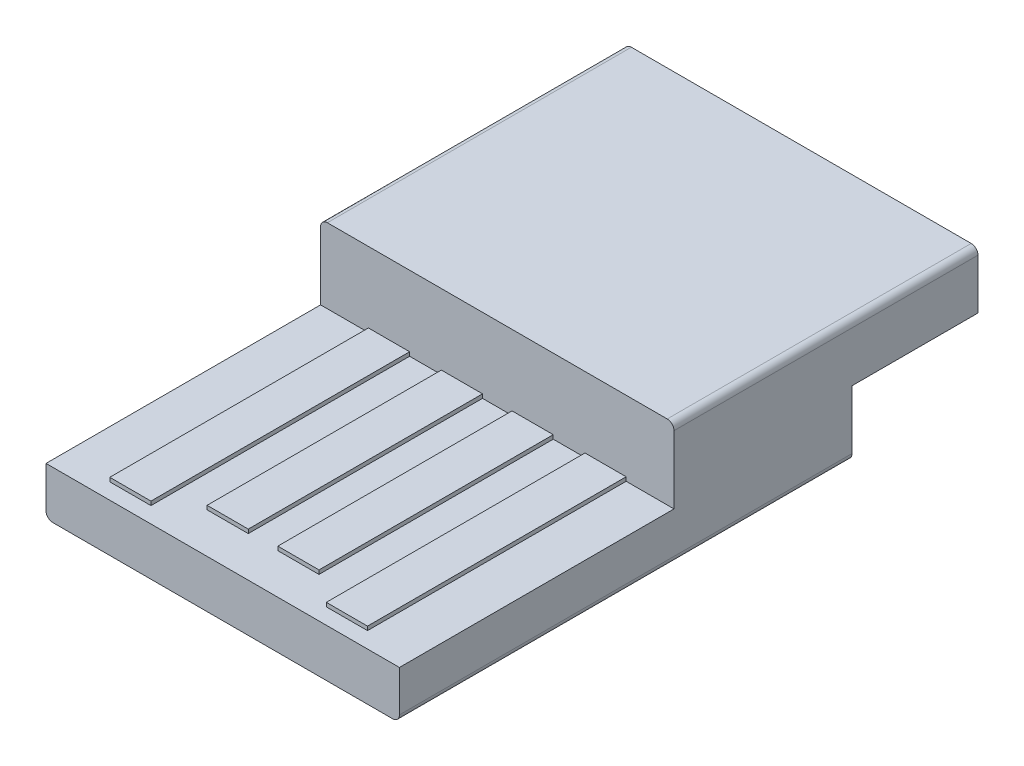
ISO-10303-21;
HEADER;
FILE_DESCRIPTION(('STEP AP214'),'2;1');
FILE_NAME('part.step','',(''),(''),'','','');
FILE_SCHEMA(('AUTOMOTIVE_DESIGN { 1 0 10303 214 1 1 1 1 }'));
ENDSEC;
DATA;
#1=APPLICATION_CONTEXT('core data for automotive mechanical design processes');
#2=APPLICATION_PROTOCOL_DEFINITION('international standard','automotive_design',2000,#1);
#3=PRODUCT_CONTEXT('',#1,'mechanical');
#4=PRODUCT('Part','Part','',(#3));
#5=PRODUCT_RELATED_PRODUCT_CATEGORY('part','',(#4));
#6=PRODUCT_DEFINITION_FORMATION('','',#4);
#7=PRODUCT_DEFINITION_CONTEXT('part definition',#1,'design');
#8=PRODUCT_DEFINITION('design','',#6,#7);
#9=PRODUCT_DEFINITION_SHAPE('','',#8);
#10=(LENGTH_UNIT() NAMED_UNIT(*) SI_UNIT(.MILLI.,.METRE.));
#11=(NAMED_UNIT(*) PLANE_ANGLE_UNIT() SI_UNIT($,.RADIAN.));
#12=(NAMED_UNIT(*) SI_UNIT($,.STERADIAN.) SOLID_ANGLE_UNIT());
#13=UNCERTAINTY_MEASURE_WITH_UNIT(LENGTH_MEASURE(1.E-05),#10,'distance_accuracy_value','');
#14=(GEOMETRIC_REPRESENTATION_CONTEXT(3) GLOBAL_UNCERTAINTY_ASSIGNED_CONTEXT((#13)) GLOBAL_UNIT_ASSIGNED_CONTEXT((#10,
#11,#12)) REPRESENTATION_CONTEXT('',''));
#15=CARTESIAN_POINT('',(0.,0.,0.));
#16=DIRECTION('',(0.,0.,1.));
#17=DIRECTION('',(1.,0.,0.));
#18=AXIS2_PLACEMENT_3D('',#15,#16,#17);
#19=CARTESIAN_POINT('',(-5.72135,-0.4318,-8.89));
#20=DIRECTION('',(0.,1.,0.));
#21=DIRECTION('',(0.,0.,1.));
#22=AXIS2_PLACEMENT_3D('',#19,#20,#21);
#23=PLANE('',#22);
#24=DIRECTION('',(-1.,0.,0.));
#25=VECTOR('',#24,1.);
#26=CARTESIAN_POINT('',(-5.72135,-0.4318,-8.89));
#27=LINE('',#26,#25);
#28=CARTESIAN_POINT('',(0.477990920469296,-0.4318,-8.89));
#29=VERTEX_POINT('',#28);
#30=CARTESIAN_POINT('',(-0.477990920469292,-0.4318,-8.89));
#31=VERTEX_POINT('',#30);
#32=EDGE_CURVE('E356',#29,#31,#27,.T.);
#33=ORIENTED_EDGE('',*,*,#32,.T.);
#34=DIRECTION('',(0.,0.,-1.));
#35=VECTOR('',#34,1.);
#36=CARTESIAN_POINT('',(-0.477990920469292,-0.4318,-1.30589617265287));
#37=LINE('',#36,#35);
#38=CARTESIAN_POINT('',(-0.477990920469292,-0.4318,-1.30589617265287));
#39=VERTEX_POINT('',#38);
#40=EDGE_CURVE('E49',#39,#31,#37,.T.);
#41=ORIENTED_EDGE('',*,*,#40,.F.);
#42=DIRECTION('',(1.,0.,0.));
#43=VECTOR('',#42,1.);
#44=CARTESIAN_POINT('',(-0.477990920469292,-0.4318,-1.30589617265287));
#45=LINE('',#44,#43);
#46=CARTESIAN_POINT('',(-1.81149092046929,-0.4318,-1.30589617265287));
#47=VERTEX_POINT('',#46);
#48=EDGE_CURVE('E54',#47,#39,#45,.T.);
#49=ORIENTED_EDGE('',*,*,#48,.F.);
#50=DIRECTION('',(0.,0.,1.));
#51=VECTOR('',#50,1.);
#52=CARTESIAN_POINT('',(-1.81149092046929,-0.4318,-1.30589617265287));
#53=LINE('',#52,#51);
#54=CARTESIAN_POINT('',(-1.81149092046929,-0.4318,-8.89));
#55=VERTEX_POINT('',#54);
#56=EDGE_CURVE('E236',#55,#47,#53,.T.);
#57=ORIENTED_EDGE('',*,*,#56,.F.);
#58=CARTESIAN_POINT('',(-2.8387230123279,-0.4318,-8.89));
#59=VERTEX_POINT('',#58);
#60=EDGE_CURVE('E35',#55,#59,#27,.T.);
#61=ORIENTED_EDGE('',*,*,#60,.T.);
#62=DIRECTION('',(0.,0.,-1.));
#63=VECTOR('',#62,1.);
#64=CARTESIAN_POINT('',(-2.8387230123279,-0.4318,-0.51559528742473));
#65=LINE('',#64,#63);
#66=CARTESIAN_POINT('',(-2.8387230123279,-0.4318,-0.51559528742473));
#67=VERTEX_POINT('',#66);
#68=EDGE_CURVE('E242',#67,#59,#65,.T.);
#69=ORIENTED_EDGE('',*,*,#68,.F.);
#70=DIRECTION('',(1.,0.,0.));
#71=VECTOR('',#70,1.);
#72=CARTESIAN_POINT('',(-2.8387230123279,-0.4318,-0.51559528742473));
#73=LINE('',#72,#71);
#74=CARTESIAN_POINT('',(-4.1722230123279,-0.4318,-0.51559528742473));
#75=VERTEX_POINT('',#74);
#76=EDGE_CURVE('E239',#75,#67,#73,.T.);
#77=ORIENTED_EDGE('',*,*,#76,.F.);
#78=DIRECTION('',(0.,0.,1.));
#79=VECTOR('',#78,1.);
#80=CARTESIAN_POINT('',(-4.1722230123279,-0.4318,-0.51559528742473));
#81=LINE('',#80,#79);
#82=CARTESIAN_POINT('',(-4.1722230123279,-0.4318,-8.89));
#83=VERTEX_POINT('',#82);
#84=EDGE_CURVE('E252',#83,#75,#81,.T.);
#85=ORIENTED_EDGE('',*,*,#84,.F.);
#86=CARTESIAN_POINT('',(-5.72135,-0.4318,-8.89));
#87=VERTEX_POINT('',#86);
#88=EDGE_CURVE('E375',#83,#87,#27,.T.);
#89=ORIENTED_EDGE('',*,*,#88,.T.);
#90=DIRECTION('',(0.,0.,1.));
#91=VECTOR('',#90,1.);
#92=CARTESIAN_POINT('',(-5.72135,-0.4318,-8.89));
#93=LINE('',#92,#91);
#94=CARTESIAN_POINT('',(-5.72135,-0.4318,0.));
#95=VERTEX_POINT('',#94);
#96=EDGE_CURVE('E41',#87,#95,#93,.T.);
#97=ORIENTED_EDGE('',*,*,#96,.T.);
#98=DIRECTION('',(-1.,0.,0.));
#99=VECTOR('',#98,1.);
#100=CARTESIAN_POINT('',(-5.72135,-0.4318,0.));
#101=LINE('',#100,#99);
#102=CARTESIAN_POINT('',(5.72135,-0.4318,0.));
#103=VERTEX_POINT('',#102);
#104=EDGE_CURVE('E380',#103,#95,#101,.T.);
#105=ORIENTED_EDGE('',*,*,#104,.F.);
#106=DIRECTION('',(0.,0.,1.));
#107=VECTOR('',#106,1.);
#108=CARTESIAN_POINT('',(5.72135,-0.4318,-8.89));
#109=LINE('',#108,#107);
#110=CARTESIAN_POINT('',(5.72135,-0.431799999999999,-8.89));
#111=VERTEX_POINT('',#110);
#112=EDGE_CURVE('E392',#111,#103,#109,.T.);
#113=ORIENTED_EDGE('',*,*,#112,.F.);
#114=CARTESIAN_POINT('',(4.1722230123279,-0.4318,-8.89));
#115=VERTEX_POINT('',#114);
#116=EDGE_CURVE('E370',#111,#115,#27,.T.);
#117=ORIENTED_EDGE('',*,*,#116,.T.);
#118=DIRECTION('',(0.,0.,-1.));
#119=VECTOR('',#118,1.);
#120=CARTESIAN_POINT('',(4.1722230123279,-0.4318,-0.51559528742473));
#121=LINE('',#120,#119);
#122=CARTESIAN_POINT('',(4.1722230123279,-0.4318,-0.51559528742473));
#123=VERTEX_POINT('',#122);
#124=EDGE_CURVE('E281',#123,#115,#121,.T.);
#125=ORIENTED_EDGE('',*,*,#124,.F.);
#126=DIRECTION('',(1.,0.,0.));
#127=VECTOR('',#126,1.);
#128=CARTESIAN_POINT('',(2.8387230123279,-0.4318,-0.51559528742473));
#129=LINE('',#128,#127);
#130=CARTESIAN_POINT('',(2.8387230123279,-0.4318,-0.51559528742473));
#131=VERTEX_POINT('',#130);
#132=EDGE_CURVE('E292',#131,#123,#129,.T.);
#133=ORIENTED_EDGE('',*,*,#132,.F.);
#134=DIRECTION('',(0.,0.,1.));
#135=VECTOR('',#134,1.);
#136=CARTESIAN_POINT('',(2.8387230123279,-0.4318,-0.51559528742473));
#137=LINE('',#136,#135);
#138=CARTESIAN_POINT('',(2.8387230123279,-0.4318,-8.89));
#139=VERTEX_POINT('',#138);
#140=EDGE_CURVE('E276',#139,#131,#137,.T.);
#141=ORIENTED_EDGE('',*,*,#140,.F.);
#142=CARTESIAN_POINT('',(1.8114909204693,-0.4318,-8.89));
#143=VERTEX_POINT('',#142);
#144=EDGE_CURVE('E358',#139,#143,#27,.T.);
#145=ORIENTED_EDGE('',*,*,#144,.T.);
#146=DIRECTION('',(0.,0.,-1.));
#147=VECTOR('',#146,1.);
#148=CARTESIAN_POINT('',(1.8114909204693,-0.4318,-1.30589617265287));
#149=LINE('',#148,#147);
#150=CARTESIAN_POINT('',(1.8114909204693,-0.4318,-1.30589617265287));
#151=VERTEX_POINT('',#150);
#152=EDGE_CURVE('E312',#151,#143,#149,.T.);
#153=ORIENTED_EDGE('',*,*,#152,.F.);
#154=DIRECTION('',(1.,0.,0.));
#155=VECTOR('',#154,1.);
#156=CARTESIAN_POINT('',(0.477990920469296,-0.4318,-1.30589617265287));
#157=LINE('',#156,#155);
#158=CARTESIAN_POINT('',(0.477990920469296,-0.4318,-1.30589617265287));
#159=VERTEX_POINT('',#158);
#160=EDGE_CURVE('E323',#159,#151,#157,.T.);
#161=ORIENTED_EDGE('',*,*,#160,.F.);
#162=DIRECTION('',(0.,0.,1.));
#163=VECTOR('',#162,1.);
#164=CARTESIAN_POINT('',(0.477990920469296,-0.4318,-1.30589617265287));
#165=LINE('',#164,#163);
#166=EDGE_CURVE('E307',#29,#159,#165,.T.);
#167=ORIENTED_EDGE('',*,*,#166,.F.);
#168=EDGE_LOOP('',(#33,#41,#49,#57,#61,#69,#77,#85,#89,#97,#105,#113,#117,#125,#133,#141,#145,
#153,#161,#167));
#169=FACE_BOUND('',#168,.T.);
#170=ADVANCED_FACE('F31',(#169),#23,.T.);
#171=CARTESIAN_POINT('',(-5.50186731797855,-1.76171731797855,-8.89));
#172=DIRECTION('',(0.,0.,-1.));
#173=DIRECTION('',(-1.,0.,0.));
#174=AXIS2_PLACEMENT_3D('',#171,#172,#173);
#175=PLANE('',#174);
#176=DIRECTION('',(0.,-1.,0.));
#177=VECTOR('',#176,1.);
#178=CARTESIAN_POINT('',(-0.477990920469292,-0.3048,-8.89));
#179=LINE('',#178,#177);
#180=CARTESIAN_POINT('',(-0.477990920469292,-0.3048,-8.89));
#181=VERTEX_POINT('',#180);
#182=EDGE_CURVE('E223',#181,#31,#179,.T.);
#183=ORIENTED_EDGE('',*,*,#182,.T.);
#184=ORIENTED_EDGE('',*,*,#32,.F.);
#185=DIRECTION('',(0.,-1.,0.));
#186=VECTOR('',#185,1.);
#187=CARTESIAN_POINT('',(0.477990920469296,-0.3048,-8.89));
#188=LINE('',#187,#186);
#189=CARTESIAN_POINT('',(0.477990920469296,-0.3048,-8.89));
#190=VERTEX_POINT('',#189);
#191=EDGE_CURVE('E320',#190,#29,#188,.T.);
#192=ORIENTED_EDGE('',*,*,#191,.F.);
#193=DIRECTION('',(-1.,0.,0.));
#194=VECTOR('',#193,1.);
#195=CARTESIAN_POINT('',(0.477990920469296,-0.3048,-8.89));
#196=LINE('',#195,#194);
#197=CARTESIAN_POINT('',(1.8114909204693,-0.3048,-8.89));
#198=VERTEX_POINT('',#197);
#199=EDGE_CURVE('E317',#198,#190,#196,.T.);
#200=ORIENTED_EDGE('',*,*,#199,.F.);
#201=DIRECTION('',(0.,-1.,0.));
#202=VECTOR('',#201,1.);
#203=CARTESIAN_POINT('',(1.8114909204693,-0.3048,-8.89));
#204=LINE('',#203,#202);
#205=EDGE_CURVE('E330',#198,#143,#204,.T.);
#206=ORIENTED_EDGE('',*,*,#205,.T.);
#207=ORIENTED_EDGE('',*,*,#144,.F.);
#208=DIRECTION('',(0.,-1.,0.));
#209=VECTOR('',#208,1.);
#210=CARTESIAN_POINT('',(2.8387230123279,-0.3048,-8.89));
#211=LINE('',#210,#209);
#212=CARTESIAN_POINT('',(2.8387230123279,-0.3048,-8.89));
#213=VERTEX_POINT('',#212);
#214=EDGE_CURVE('E289',#213,#139,#211,.T.);
#215=ORIENTED_EDGE('',*,*,#214,.F.);
#216=DIRECTION('',(-1.,0.,0.));
#217=VECTOR('',#216,1.);
#218=CARTESIAN_POINT('',(2.8387230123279,-0.3048,-8.89));
#219=LINE('',#218,#217);
#220=CARTESIAN_POINT('',(4.1722230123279,-0.3048,-8.89));
#221=VERTEX_POINT('',#220);
#222=EDGE_CURVE('E286',#221,#213,#219,.T.);
#223=ORIENTED_EDGE('',*,*,#222,.F.);
#224=DIRECTION('',(0.,-1.,0.));
#225=VECTOR('',#224,1.);
#226=CARTESIAN_POINT('',(4.1722230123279,-0.3048,-8.89));
#227=LINE('',#226,#225);
#228=EDGE_CURVE('E299',#221,#115,#227,.T.);
#229=ORIENTED_EDGE('',*,*,#228,.T.);
#230=ORIENTED_EDGE('',*,*,#116,.F.);
#231=DIRECTION('',(0.,-1.,0.));
#232=VECTOR('',#231,1.);
#233=CARTESIAN_POINT('',(5.72135,1.76171731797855,-8.89));
#234=LINE('',#233,#232);
#235=CARTESIAN_POINT('',(5.72135,1.76171731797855,-8.89));
#236=VERTEX_POINT('',#235);
#237=EDGE_CURVE('E423',#236,#111,#234,.T.);
#238=ORIENTED_EDGE('',*,*,#237,.F.);
#239=CARTESIAN_POINT('',(5.50186731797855,1.76171731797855,-8.89));
#240=DIRECTION('',(0.,0.,-1.));
#241=DIRECTION('',(-1.,0.,0.));
#242=AXIS2_PLACEMENT_3D('',#239,#240,#241);
#243=CIRCLE('',#242,0.21948268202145);
#244=CARTESIAN_POINT('',(5.50186731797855,1.9812,-8.89));
#245=VERTEX_POINT('',#244);
#246=EDGE_CURVE('E433',#245,#236,#243,.T.);
#247=ORIENTED_EDGE('',*,*,#246,.F.);
#248=DIRECTION('',(1.,0.,0.));
#249=VECTOR('',#248,1.);
#250=CARTESIAN_POINT('',(5.50186731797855,1.9812,-8.89));
#251=LINE('',#250,#249);
#252=CARTESIAN_POINT('',(-5.50186731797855,1.9812,-8.89));
#253=VERTEX_POINT('',#252);
#254=EDGE_CURVE('E430',#253,#245,#251,.T.);
#255=ORIENTED_EDGE('',*,*,#254,.F.);
#256=CARTESIAN_POINT('',(-5.50186731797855,1.76171731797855,-8.89));
#257=DIRECTION('',(0.,0.,-1.));
#258=DIRECTION('',(-1.,0.,0.));
#259=AXIS2_PLACEMENT_3D('',#256,#257,#258);
#260=CIRCLE('',#259,0.21948268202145);
#261=CARTESIAN_POINT('',(-5.72135,1.76171731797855,-8.89));
#262=VERTEX_POINT('',#261);
#263=EDGE_CURVE('E427',#262,#253,#260,.T.);
#264=ORIENTED_EDGE('',*,*,#263,.F.);
#265=DIRECTION('',(0.,1.,0.));
#266=VECTOR('',#265,1.);
#267=CARTESIAN_POINT('',(-5.72135,-1.76171731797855,-8.89));
#268=LINE('',#267,#266);
#269=EDGE_CURVE('E362',#87,#262,#268,.T.);
#270=ORIENTED_EDGE('',*,*,#269,.F.);
#271=ORIENTED_EDGE('',*,*,#88,.F.);
#272=DIRECTION('',(0.,-1.,0.));
#273=VECTOR('',#272,1.);
#274=CARTESIAN_POINT('',(-4.1722230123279,-0.3048,-8.89));
#275=LINE('',#274,#273);
#276=CARTESIAN_POINT('',(-4.1722230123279,-0.3048,-8.89));
#277=VERTEX_POINT('',#276);
#278=EDGE_CURVE('E267',#277,#83,#275,.T.);
#279=ORIENTED_EDGE('',*,*,#278,.F.);
#280=DIRECTION('',(-1.,0.,0.));
#281=VECTOR('',#280,1.);
#282=CARTESIAN_POINT('',(-2.8387230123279,-0.3048,-8.89));
#283=LINE('',#282,#281);
#284=CARTESIAN_POINT('',(-2.8387230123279,-0.3048,-8.89));
#285=VERTEX_POINT('',#284);
#286=EDGE_CURVE('E255',#285,#277,#283,.T.);
#287=ORIENTED_EDGE('',*,*,#286,.F.);
#288=DIRECTION('',(0.,-1.,0.));
#289=VECTOR('',#288,1.);
#290=CARTESIAN_POINT('',(-2.8387230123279,-0.3048,-8.89));
#291=LINE('',#290,#289);
#292=EDGE_CURVE('E270',#285,#59,#291,.T.);
#293=ORIENTED_EDGE('',*,*,#292,.T.);
#294=ORIENTED_EDGE('',*,*,#60,.F.);
#295=DIRECTION('',(0.,-1.,0.));
#296=VECTOR('',#295,1.);
#297=CARTESIAN_POINT('',(-1.81149092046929,-0.3048,-8.89));
#298=LINE('',#297,#296);
#299=CARTESIAN_POINT('',(-1.81149092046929,-0.3048,-8.89));
#300=VERTEX_POINT('',#299);
#301=EDGE_CURVE('E244',#300,#55,#298,.T.);
#302=ORIENTED_EDGE('',*,*,#301,.F.);
#303=DIRECTION('',(-1.,0.,0.));
#304=VECTOR('',#303,1.);
#305=CARTESIAN_POINT('',(-0.477990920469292,-0.3048,-8.89));
#306=LINE('',#305,#304);
#307=EDGE_CURVE('E226',#181,#300,#306,.T.);
#308=ORIENTED_EDGE('',*,*,#307,.F.);
#309=EDGE_LOOP('',(#183,#184,#192,#200,#206,#207,#215,#223,#229,#230,#238,#247,#255,#264,#270,
#271,#279,#287,#293,#294,#302,#308));
#310=FACE_BOUND('',#309,.T.);
#311=ADVANCED_FACE('F500',(#310),#175,.F.);
#312=CARTESIAN_POINT('',(-5.50186731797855,-1.76171731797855,-8.89));
#313=DIRECTION('',(0.,0.,1.));
#314=DIRECTION('',(1.,0.,0.));
#315=AXIS2_PLACEMENT_3D('',#312,#313,#314);
#316=CYLINDRICAL_SURFACE('',#315,0.21948268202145);
#317=CARTESIAN_POINT('',(-5.50186731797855,-1.76171731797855,0.));
#318=DIRECTION('',(0.,0.,1.));
#319=DIRECTION('',(1.,0.,0.));
#320=AXIS2_PLACEMENT_3D('',#317,#318,#319);
#321=CIRCLE('',#320,0.21948268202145);
#322=CARTESIAN_POINT('',(-5.72135,-1.76171731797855,0.));
#323=VERTEX_POINT('',#322);
#324=CARTESIAN_POINT('',(-5.50186731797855,-1.9812,0.));
#325=VERTEX_POINT('',#324);
#326=EDGE_CURVE('E365',#323,#325,#321,.T.);
#327=ORIENTED_EDGE('',*,*,#326,.F.);
#328=DIRECTION('',(0.,0.,1.));
#329=VECTOR('',#328,1.);
#330=CARTESIAN_POINT('',(-5.72135,-1.76171731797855,-8.89));
#331=LINE('',#330,#329);
#332=CARTESIAN_POINT('',(-5.72135,-1.76171731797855,-14.6558));
#333=VERTEX_POINT('',#332);
#334=EDGE_CURVE('E11',#333,#323,#331,.T.);
#335=ORIENTED_EDGE('',*,*,#334,.F.);
#336=CARTESIAN_POINT('',(-5.50186731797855,-1.76171731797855,-14.6558));
#337=DIRECTION('',(0.,0.,-1.));
#338=DIRECTION('',(-1.,0.,0.));
#339=AXIS2_PLACEMENT_3D('',#336,#337,#338);
#340=CIRCLE('',#339,0.219482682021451);
#341=CARTESIAN_POINT('',(-5.50186731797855,-1.9812,-14.6558));
#342=VERTEX_POINT('',#341);
#343=EDGE_CURVE('E412',#342,#333,#340,.T.);
#344=ORIENTED_EDGE('',*,*,#343,.F.);
#345=DIRECTION('',(0.,0.,1.));
#346=VECTOR('',#345,1.);
#347=CARTESIAN_POINT('',(-5.50186731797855,-1.9812,-8.89));
#348=LINE('',#347,#346);
#349=EDGE_CURVE('E395',#342,#325,#348,.T.);
#350=ORIENTED_EDGE('',*,*,#349,.T.);
#351=EDGE_LOOP('',(#327,#335,#344,#350));
#352=FACE_BOUND('',#351,.T.);
#353=ADVANCED_FACE('F33',(#352),#316,.T.);
#354=CARTESIAN_POINT('',(-5.72135,-0.4318,-8.89));
#355=DIRECTION('',(-1.,0.,0.));
#356=DIRECTION('',(0.,0.,1.));
#357=AXIS2_PLACEMENT_3D('',#354,#355,#356);
#358=PLANE('',#357);
#359=DIRECTION('',(0.,-1.,0.));
#360=VECTOR('',#359,1.);
#361=CARTESIAN_POINT('',(-5.72135,-0.4318,0.));
#362=LINE('',#361,#360);
#363=EDGE_CURVE('E376',#95,#323,#362,.T.);
#364=ORIENTED_EDGE('',*,*,#363,.F.);
#365=ORIENTED_EDGE('',*,*,#96,.F.);
#366=ORIENTED_EDGE('',*,*,#269,.T.);
#367=DIRECTION('',(0.,0.,1.));
#368=VECTOR('',#367,1.);
#369=CARTESIAN_POINT('',(-5.72135,1.76171731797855,-26.7651351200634));
#370=LINE('',#369,#368);
#371=CARTESIAN_POINT('',(-5.72135,1.76171731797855,-18.7325));
#372=VERTEX_POINT('',#371);
#373=EDGE_CURVE('E424',#372,#262,#370,.T.);
#374=ORIENTED_EDGE('',*,*,#373,.F.);
#375=DIRECTION('',(0.,1.,0.));
#376=VECTOR('',#375,1.);
#377=CARTESIAN_POINT('',(-5.72135,0.139699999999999,-18.7325));
#378=LINE('',#377,#376);
#379=CARTESIAN_POINT('',(-5.72135,0.139699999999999,-18.7325));
#380=VERTEX_POINT('',#379);
#381=EDGE_CURVE('E476',#380,#372,#378,.T.);
#382=ORIENTED_EDGE('',*,*,#381,.F.);
#383=DIRECTION('',(0.,0.,1.));
#384=VECTOR('',#383,1.);
#385=CARTESIAN_POINT('',(-5.72135,0.139699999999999,-30.3224312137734));
#386=LINE('',#385,#384);
#387=CARTESIAN_POINT('',(-5.72135,0.139699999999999,-14.6558));
#388=VERTEX_POINT('',#387);
#389=EDGE_CURVE('E349',#380,#388,#386,.T.);
#390=ORIENTED_EDGE('',*,*,#389,.T.);
#391=DIRECTION('',(0.,1.,0.));
#392=VECTOR('',#391,1.);
#393=CARTESIAN_POINT('',(-5.72135,-1.76171731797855,-14.6558));
#394=LINE('',#393,#392);
#395=EDGE_CURVE('E408',#333,#388,#394,.T.);
#396=ORIENTED_EDGE('',*,*,#395,.F.);
#397=ORIENTED_EDGE('',*,*,#334,.T.);
#398=EDGE_LOOP('',(#364,#365,#366,#374,#382,#390,#396,#397));
#399=FACE_BOUND('',#398,.T.);
#400=ADVANCED_FACE('F473',(#399),#358,.T.);
#401=CARTESIAN_POINT('',(5.72135,-1.76171731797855,-8.89));
#402=DIRECTION('',(1.,0.,0.));
#403=DIRECTION('',(0.,0.,-1.));
#404=AXIS2_PLACEMENT_3D('',#401,#402,#403);
#405=PLANE('',#404);
#406=DIRECTION('',(0.,1.,0.));
#407=VECTOR('',#406,1.);
#408=CARTESIAN_POINT('',(5.72135,-1.76171731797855,0.));
#409=LINE('',#408,#407);
#410=CARTESIAN_POINT('',(5.72135,-1.76171731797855,0.));
#411=VERTEX_POINT('',#410);
#412=EDGE_CURVE('E386',#411,#103,#409,.T.);
#413=ORIENTED_EDGE('',*,*,#412,.F.);
#414=DIRECTION('',(0.,0.,1.));
#415=VECTOR('',#414,1.);
#416=CARTESIAN_POINT('',(5.72135,-1.76171731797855,-8.89));
#417=LINE('',#416,#415);
#418=CARTESIAN_POINT('',(5.72135,-1.76171731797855,-14.6558));
#419=VERTEX_POINT('',#418);
#420=EDGE_CURVE('E390',#419,#411,#417,.T.);
#421=ORIENTED_EDGE('',*,*,#420,.F.);
#422=DIRECTION('',(0.,-1.,0.));
#423=VECTOR('',#422,1.);
#424=CARTESIAN_POINT('',(5.72135,1.76171731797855,-14.6558));
#425=LINE('',#424,#423);
#426=CARTESIAN_POINT('',(5.72135,0.139699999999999,-14.6558));
#427=VERTEX_POINT('',#426);
#428=EDGE_CURVE('E411',#427,#419,#425,.T.);
#429=ORIENTED_EDGE('',*,*,#428,.F.);
#430=DIRECTION('',(0.,0.,1.));
#431=VECTOR('',#430,1.);
#432=CARTESIAN_POINT('',(5.72135,0.139699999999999,-30.3224312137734));
#433=LINE('',#432,#431);
#434=CARTESIAN_POINT('',(5.72135,0.139699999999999,-18.7325));
#435=VERTEX_POINT('',#434);
#436=EDGE_CURVE('E339',#435,#427,#433,.T.);
#437=ORIENTED_EDGE('',*,*,#436,.F.);
#438=DIRECTION('',(0.,-1.,0.));
#439=VECTOR('',#438,1.);
#440=CARTESIAN_POINT('',(5.72135,1.76171731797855,-18.7325));
#441=LINE('',#440,#439);
#442=CARTESIAN_POINT('',(5.72135,1.76171731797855,-18.7325));
#443=VERTEX_POINT('',#442);
#444=EDGE_CURVE('E483',#443,#435,#441,.T.);
#445=ORIENTED_EDGE('',*,*,#444,.F.);
#446=DIRECTION('',(0.,0.,1.));
#447=VECTOR('',#446,1.);
#448=CARTESIAN_POINT('',(5.72135,1.76171731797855,-26.7651351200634));
#449=LINE('',#448,#447);
#450=EDGE_CURVE('E434',#443,#236,#449,.T.);
#451=ORIENTED_EDGE('',*,*,#450,.T.);
#452=ORIENTED_EDGE('',*,*,#237,.T.);
#453=ORIENTED_EDGE('',*,*,#112,.T.);
#454=EDGE_LOOP('',(#413,#421,#429,#437,#445,#451,#452,#453));
#455=FACE_BOUND('',#454,.T.);
#456=ADVANCED_FACE('F456',(#455),#405,.T.);
#457=CARTESIAN_POINT('',(5.50186731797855,-1.76171731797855,-8.89));
#458=DIRECTION('',(0.,0.,1.));
#459=DIRECTION('',(1.,0.,0.));
#460=AXIS2_PLACEMENT_3D('',#457,#458,#459);
#461=CYLINDRICAL_SURFACE('',#460,0.219482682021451);
#462=CARTESIAN_POINT('',(5.50186731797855,-1.76171731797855,0.));
#463=DIRECTION('',(0.,0.,1.));
#464=DIRECTION('',(1.,0.,0.));
#465=AXIS2_PLACEMENT_3D('',#462,#463,#464);
#466=CIRCLE('',#465,0.219482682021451);
#467=CARTESIAN_POINT('',(5.50186731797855,-1.9812,0.));
#468=VERTEX_POINT('',#467);
#469=EDGE_CURVE('E463',#468,#411,#466,.T.);
#470=ORIENTED_EDGE('',*,*,#469,.F.);
#471=DIRECTION('',(0.,0.,1.));
#472=VECTOR('',#471,1.);
#473=CARTESIAN_POINT('',(5.50186731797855,-1.9812,-8.89));
#474=LINE('',#473,#472);
#475=CARTESIAN_POINT('',(5.50186731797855,-1.9812,-14.6558));
#476=VERTEX_POINT('',#475);
#477=EDGE_CURVE('E393',#476,#468,#474,.T.);
#478=ORIENTED_EDGE('',*,*,#477,.F.);
#479=CARTESIAN_POINT('',(5.50186731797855,-1.76171731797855,-14.6558));
#480=DIRECTION('',(0.,0.,-1.));
#481=DIRECTION('',(-1.,0.,0.));
#482=AXIS2_PLACEMENT_3D('',#479,#480,#481);
#483=CIRCLE('',#482,0.219482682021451);
#484=EDGE_CURVE('E447',#419,#476,#483,.T.);
#485=ORIENTED_EDGE('',*,*,#484,.F.);
#486=ORIENTED_EDGE('',*,*,#420,.T.);
#487=EDGE_LOOP('',(#470,#478,#485,#486));
#488=FACE_BOUND('',#487,.T.);
#489=ADVANCED_FACE('F461',(#488),#461,.T.);
#490=CARTESIAN_POINT('',(0.00635000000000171,-1.9812,-8.89));
#491=DIRECTION('',(0.,-1.,0.));
#492=DIRECTION('',(0.,0.,-1.));
#493=AXIS2_PLACEMENT_3D('',#490,#491,#492);
#494=PLANE('',#493);
#495=DIRECTION('',(1.,0.,0.));
#496=VECTOR('',#495,1.);
#497=CARTESIAN_POINT('',(0.00635000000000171,-1.9812,0.));
#498=LINE('',#497,#496);
#499=EDGE_CURVE('E451',#325,#468,#498,.T.);
#500=ORIENTED_EDGE('',*,*,#499,.F.);
#501=ORIENTED_EDGE('',*,*,#349,.F.);
#502=DIRECTION('',(-1.,0.,0.));
#503=VECTOR('',#502,1.);
#504=CARTESIAN_POINT('',(5.50186731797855,-1.9812,-14.6558));
#505=LINE('',#504,#503);
#506=EDGE_CURVE('E420',#476,#342,#505,.T.);
#507=ORIENTED_EDGE('',*,*,#506,.F.);
#508=ORIENTED_EDGE('',*,*,#477,.T.);
#509=EDGE_LOOP('',(#500,#501,#507,#508));
#510=FACE_BOUND('',#509,.T.);
#511=ADVANCED_FACE('F466',(#510),#494,.T.);
#512=CARTESIAN_POINT('',(-5.50186731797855,-1.76171731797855,0.));
#513=DIRECTION('',(0.,0.,1.));
#514=DIRECTION('',(1.,0.,0.));
#515=AXIS2_PLACEMENT_3D('',#512,#513,#514);
#516=PLANE('',#515);
#517=ORIENTED_EDGE('',*,*,#326,.T.);
#518=ORIENTED_EDGE('',*,*,#499,.T.);
#519=ORIENTED_EDGE('',*,*,#469,.T.);
#520=ORIENTED_EDGE('',*,*,#412,.T.);
#521=ORIENTED_EDGE('',*,*,#104,.T.);
#522=ORIENTED_EDGE('',*,*,#363,.T.);
#523=EDGE_LOOP('',(#517,#518,#519,#520,#521,#522));
#524=FACE_BOUND('',#523,.T.);
#525=ADVANCED_FACE('F508',(#524),#516,.T.);
#526=CARTESIAN_POINT('',(-5.50186731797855,1.76171731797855,-26.7651351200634));
#527=DIRECTION('',(0.,0.,1.));
#528=DIRECTION('',(1.,0.,0.));
#529=AXIS2_PLACEMENT_3D('',#526,#527,#528);
#530=CYLINDRICAL_SURFACE('',#529,0.21948268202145);
#531=DIRECTION('',(0.,0.,1.));
#532=VECTOR('',#531,1.);
#533=CARTESIAN_POINT('',(-5.50186731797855,1.9812,-26.7651351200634));
#534=LINE('',#533,#532);
#535=CARTESIAN_POINT('',(-5.50186731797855,1.9812,-18.7325));
#536=VERTEX_POINT('',#535);
#537=EDGE_CURVE('E428',#536,#253,#534,.T.);
#538=ORIENTED_EDGE('',*,*,#537,.F.);
#539=CARTESIAN_POINT('',(-5.50186731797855,1.76171731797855,-18.7325));
#540=DIRECTION('',(0.,0.,-1.));
#541=DIRECTION('',(-1.,0.,0.));
#542=AXIS2_PLACEMENT_3D('',#539,#540,#541);
#543=CIRCLE('',#542,0.219482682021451);
#544=EDGE_CURVE('E491',#372,#536,#543,.T.);
#545=ORIENTED_EDGE('',*,*,#544,.F.);
#546=ORIENTED_EDGE('',*,*,#373,.T.);
#547=ORIENTED_EDGE('',*,*,#263,.T.);
#548=EDGE_LOOP('',(#538,#545,#546,#547));
#549=FACE_BOUND('',#548,.T.);
#550=ADVANCED_FACE('F498',(#549),#530,.T.);
#551=CARTESIAN_POINT('',(5.50186731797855,1.9812,-26.7651351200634));
#552=DIRECTION('',(0.,-1.,0.));
#553=DIRECTION('',(0.,0.,-1.));
#554=AXIS2_PLACEMENT_3D('',#551,#552,#553);
#555=PLANE('',#554);
#556=DIRECTION('',(0.,0.,1.));
#557=VECTOR('',#556,1.);
#558=CARTESIAN_POINT('',(5.50186731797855,1.9812,-26.7651351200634));
#559=LINE('',#558,#557);
#560=CARTESIAN_POINT('',(5.50186731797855,1.9812,-18.7325));
#561=VERTEX_POINT('',#560);
#562=EDGE_CURVE('E431',#561,#245,#559,.T.);
#563=ORIENTED_EDGE('',*,*,#562,.F.);
#564=DIRECTION('',(1.,0.,0.));
#565=VECTOR('',#564,1.);
#566=CARTESIAN_POINT('',(-5.50186731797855,1.9812,-18.7325));
#567=LINE('',#566,#565);
#568=EDGE_CURVE('E342',#536,#561,#567,.T.);
#569=ORIENTED_EDGE('',*,*,#568,.F.);
#570=ORIENTED_EDGE('',*,*,#537,.T.);
#571=ORIENTED_EDGE('',*,*,#254,.T.);
#572=EDGE_LOOP('',(#563,#569,#570,#571));
#573=FACE_BOUND('',#572,.T.);
#574=ADVANCED_FACE('F504',(#573),#555,.F.);
#575=CARTESIAN_POINT('',(5.50186731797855,1.76171731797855,-26.7651351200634));
#576=DIRECTION('',(0.,0.,1.));
#577=DIRECTION('',(1.,0.,0.));
#578=AXIS2_PLACEMENT_3D('',#575,#576,#577);
#579=CYLINDRICAL_SURFACE('',#578,0.21948268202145);
#580=ORIENTED_EDGE('',*,*,#450,.F.);
#581=CARTESIAN_POINT('',(5.50186731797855,1.76171731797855,-18.7325));
#582=DIRECTION('',(0.,0.,-1.));
#583=DIRECTION('',(-1.,0.,0.));
#584=AXIS2_PLACEMENT_3D('',#581,#582,#583);
#585=CIRCLE('',#584,0.21948268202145);
#586=EDGE_CURVE('E439',#561,#443,#585,.T.);
#587=ORIENTED_EDGE('',*,*,#586,.F.);
#588=ORIENTED_EDGE('',*,*,#562,.T.);
#589=ORIENTED_EDGE('',*,*,#246,.T.);
#590=EDGE_LOOP('',(#580,#587,#588,#589));
#591=FACE_BOUND('',#590,.T.);
#592=ADVANCED_FACE('F506',(#591),#579,.T.);
#593=CARTESIAN_POINT('',(-6.00175,-2.2606,-14.6558));
#594=DIRECTION('',(0.,0.,-1.));
#595=DIRECTION('',(-1.,0.,0.));
#596=AXIS2_PLACEMENT_3D('',#593,#594,#595);
#597=PLANE('',#596);
#598=DIRECTION('',(-1.,0.,0.));
#599=VECTOR('',#598,1.);
#600=CARTESIAN_POINT('',(5.72135,0.139699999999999,-14.6558));
#601=LINE('',#600,#599);
#602=EDGE_CURVE('E345',#427,#388,#601,.T.);
#603=ORIENTED_EDGE('',*,*,#602,.F.);
#604=ORIENTED_EDGE('',*,*,#428,.T.);
#605=ORIENTED_EDGE('',*,*,#484,.T.);
#606=ORIENTED_EDGE('',*,*,#506,.T.);
#607=ORIENTED_EDGE('',*,*,#343,.T.);
#608=ORIENTED_EDGE('',*,*,#395,.T.);
#609=EDGE_LOOP('',(#603,#604,#605,#606,#607,#608));
#610=FACE_BOUND('',#609,.T.);
#611=ADVANCED_FACE('F454',(#610),#597,.T.);
#612=CARTESIAN_POINT('',(5.72135,0.139699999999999,-30.3224312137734));
#613=DIRECTION('',(0.,1.,0.));
#614=DIRECTION('',(0.,0.,1.));
#615=AXIS2_PLACEMENT_3D('',#612,#613,#614);
#616=PLANE('',#615);
#617=DIRECTION('',(-1.,0.,0.));
#618=VECTOR('',#617,1.);
#619=CARTESIAN_POINT('',(5.72135,0.139699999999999,-18.7325));
#620=LINE('',#619,#618);
#621=EDGE_CURVE('E480',#435,#380,#620,.T.);
#622=ORIENTED_EDGE('',*,*,#621,.F.);
#623=ORIENTED_EDGE('',*,*,#436,.T.);
#624=ORIENTED_EDGE('',*,*,#602,.T.);
#625=ORIENTED_EDGE('',*,*,#389,.F.);
#626=EDGE_LOOP('',(#622,#623,#624,#625));
#627=FACE_BOUND('',#626,.T.);
#628=ADVANCED_FACE('F479',(#627),#616,.F.);
#629=CARTESIAN_POINT('',(-6.00075,2.2606,-18.7325));
#630=DIRECTION('',(0.,0.,-1.));
#631=DIRECTION('',(-1.,0.,0.));
#632=AXIS2_PLACEMENT_3D('',#629,#630,#631);
#633=PLANE('',#632);
#634=ORIENTED_EDGE('',*,*,#586,.T.);
#635=ORIENTED_EDGE('',*,*,#444,.T.);
#636=ORIENTED_EDGE('',*,*,#621,.T.);
#637=ORIENTED_EDGE('',*,*,#381,.T.);
#638=ORIENTED_EDGE('',*,*,#544,.T.);
#639=ORIENTED_EDGE('',*,*,#568,.T.);
#640=EDGE_LOOP('',(#634,#635,#636,#637,#638,#639));
#641=FACE_BOUND('',#640,.T.);
#642=ADVANCED_FACE('F486',(#641),#633,.T.);
#643=CARTESIAN_POINT('',(0.477990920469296,-0.3048,-1.30589617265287));
#644=DIRECTION('',(1.,0.,0.));
#645=DIRECTION('',(0.,0.,-1.));
#646=AXIS2_PLACEMENT_3D('',#643,#644,#645);
#647=PLANE('',#646);
#648=ORIENTED_EDGE('',*,*,#166,.T.);
#649=DIRECTION('',(0.,-1.,0.));
#650=VECTOR('',#649,1.);
#651=CARTESIAN_POINT('',(0.477990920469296,-0.3048,-1.30589617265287));
#652=LINE('',#651,#650);
#653=CARTESIAN_POINT('',(0.477990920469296,-0.3048,-1.30589617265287));
#654=VERTEX_POINT('',#653);
#655=EDGE_CURVE('E336',#654,#159,#652,.T.);
#656=ORIENTED_EDGE('',*,*,#655,.F.);
#657=DIRECTION('',(0.,0.,1.));
#658=VECTOR('',#657,1.);
#659=CARTESIAN_POINT('',(0.477990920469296,-0.3048,-1.30589617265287));
#660=LINE('',#659,#658);
#661=EDGE_CURVE('E308',#190,#654,#660,.T.);
#662=ORIENTED_EDGE('',*,*,#661,.F.);
#663=ORIENTED_EDGE('',*,*,#191,.T.);
#664=EDGE_LOOP('',(#648,#656,#662,#663));
#665=FACE_BOUND('',#664,.T.);
#666=ADVANCED_FACE('F601',(#665),#647,.F.);
#667=CARTESIAN_POINT('',(0.477990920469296,-0.3048,-1.30589617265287));
#668=DIRECTION('',(0.,0.,-1.));
#669=DIRECTION('',(-1.,0.,0.));
#670=AXIS2_PLACEMENT_3D('',#667,#668,#669);
#671=PLANE('',#670);
#672=ORIENTED_EDGE('',*,*,#160,.T.);
#673=DIRECTION('',(0.,-1.,0.));
#674=VECTOR('',#673,1.);
#675=CARTESIAN_POINT('',(1.8114909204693,-0.3048,-1.30589617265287));
#676=LINE('',#675,#674);
#677=CARTESIAN_POINT('',(1.8114909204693,-0.3048,-1.30589617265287));
#678=VERTEX_POINT('',#677);
#679=EDGE_CURVE('E333',#678,#151,#676,.T.);
#680=ORIENTED_EDGE('',*,*,#679,.F.);
#681=DIRECTION('',(1.,0.,0.));
#682=VECTOR('',#681,1.);
#683=CARTESIAN_POINT('',(0.477990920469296,-0.3048,-1.30589617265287));
#684=LINE('',#683,#682);
#685=EDGE_CURVE('E311',#654,#678,#684,.T.);
#686=ORIENTED_EDGE('',*,*,#685,.F.);
#687=ORIENTED_EDGE('',*,*,#655,.T.);
#688=EDGE_LOOP('',(#672,#680,#686,#687));
#689=FACE_BOUND('',#688,.T.);
#690=ADVANCED_FACE('F621',(#689),#671,.F.);
#691=CARTESIAN_POINT('',(1.8114909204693,-0.3048,-1.30589617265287));
#692=DIRECTION('',(-1.,0.,0.));
#693=DIRECTION('',(0.,0.,1.));
#694=AXIS2_PLACEMENT_3D('',#691,#692,#693);
#695=PLANE('',#694);
#696=ORIENTED_EDGE('',*,*,#152,.T.);
#697=ORIENTED_EDGE('',*,*,#205,.F.);
#698=DIRECTION('',(0.,0.,-1.));
#699=VECTOR('',#698,1.);
#700=CARTESIAN_POINT('',(1.8114909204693,-0.3048,-1.30589617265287));
#701=LINE('',#700,#699);
#702=EDGE_CURVE('E314',#678,#198,#701,.T.);
#703=ORIENTED_EDGE('',*,*,#702,.F.);
#704=ORIENTED_EDGE('',*,*,#679,.T.);
#705=EDGE_LOOP('',(#696,#697,#703,#704));
#706=FACE_BOUND('',#705,.T.);
#707=ADVANCED_FACE('F631',(#706),#695,.F.);
#708=CARTESIAN_POINT('',(0.477990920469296,-0.3048,-8.89));
#709=DIRECTION('',(0.,-1.,0.));
#710=DIRECTION('',(0.,0.,-1.));
#711=AXIS2_PLACEMENT_3D('',#708,#709,#710);
#712=PLANE('',#711);
#713=ORIENTED_EDGE('',*,*,#661,.T.);
#714=ORIENTED_EDGE('',*,*,#685,.T.);
#715=ORIENTED_EDGE('',*,*,#702,.T.);
#716=ORIENTED_EDGE('',*,*,#199,.T.);
#717=EDGE_LOOP('',(#713,#714,#715,#716));
#718=FACE_BOUND('',#717,.T.);
#719=ADVANCED_FACE('F641',(#718),#712,.F.);
#720=CARTESIAN_POINT('',(2.8387230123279,-0.3048,-0.51559528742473));
#721=DIRECTION('',(1.,0.,0.));
#722=DIRECTION('',(0.,0.,-1.));
#723=AXIS2_PLACEMENT_3D('',#720,#721,#722);
#724=PLANE('',#723);
#725=ORIENTED_EDGE('',*,*,#140,.T.);
#726=DIRECTION('',(0.,-1.,0.));
#727=VECTOR('',#726,1.);
#728=CARTESIAN_POINT('',(2.8387230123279,-0.3048,-0.51559528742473));
#729=LINE('',#728,#727);
#730=CARTESIAN_POINT('',(2.8387230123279,-0.3048,-0.51559528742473));
#731=VERTEX_POINT('',#730);
#732=EDGE_CURVE('E304',#731,#131,#729,.T.);
#733=ORIENTED_EDGE('',*,*,#732,.F.);
#734=DIRECTION('',(0.,0.,1.));
#735=VECTOR('',#734,1.);
#736=CARTESIAN_POINT('',(2.8387230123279,-0.3048,-0.51559528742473));
#737=LINE('',#736,#735);
#738=EDGE_CURVE('E277',#213,#731,#737,.T.);
#739=ORIENTED_EDGE('',*,*,#738,.F.);
#740=ORIENTED_EDGE('',*,*,#214,.T.);
#741=EDGE_LOOP('',(#725,#733,#739,#740));
#742=FACE_BOUND('',#741,.T.);
#743=ADVANCED_FACE('F651',(#742),#724,.F.);
#744=CARTESIAN_POINT('',(2.8387230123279,-0.3048,-0.51559528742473));
#745=DIRECTION('',(0.,0.,-1.));
#746=DIRECTION('',(-1.,0.,0.));
#747=AXIS2_PLACEMENT_3D('',#744,#745,#746);
#748=PLANE('',#747);
#749=ORIENTED_EDGE('',*,*,#132,.T.);
#750=DIRECTION('',(0.,-1.,0.));
#751=VECTOR('',#750,1.);
#752=CARTESIAN_POINT('',(4.1722230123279,-0.3048,-0.51559528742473));
#753=LINE('',#752,#751);
#754=CARTESIAN_POINT('',(4.1722230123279,-0.3048,-0.51559528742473));
#755=VERTEX_POINT('',#754);
#756=EDGE_CURVE('E301',#755,#123,#753,.T.);
#757=ORIENTED_EDGE('',*,*,#756,.F.);
#758=DIRECTION('',(1.,0.,0.));
#759=VECTOR('',#758,1.);
#760=CARTESIAN_POINT('',(2.8387230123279,-0.3048,-0.51559528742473));
#761=LINE('',#760,#759);
#762=EDGE_CURVE('E280',#731,#755,#761,.T.);
#763=ORIENTED_EDGE('',*,*,#762,.F.);
#764=ORIENTED_EDGE('',*,*,#732,.T.);
#765=EDGE_LOOP('',(#749,#757,#763,#764));
#766=FACE_BOUND('',#765,.T.);
#767=ADVANCED_FACE('F661',(#766),#748,.F.);
#768=CARTESIAN_POINT('',(4.1722230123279,-0.3048,-0.51559528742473));
#769=DIRECTION('',(-1.,0.,0.));
#770=DIRECTION('',(0.,0.,1.));
#771=AXIS2_PLACEMENT_3D('',#768,#769,#770);
#772=PLANE('',#771);
#773=ORIENTED_EDGE('',*,*,#124,.T.);
#774=ORIENTED_EDGE('',*,*,#228,.F.);
#775=DIRECTION('',(0.,0.,-1.));
#776=VECTOR('',#775,1.);
#777=CARTESIAN_POINT('',(4.1722230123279,-0.3048,-0.51559528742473));
#778=LINE('',#777,#776);
#779=EDGE_CURVE('E283',#755,#221,#778,.T.);
#780=ORIENTED_EDGE('',*,*,#779,.F.);
#781=ORIENTED_EDGE('',*,*,#756,.T.);
#782=EDGE_LOOP('',(#773,#774,#780,#781));
#783=FACE_BOUND('',#782,.T.);
#784=ADVANCED_FACE('F671',(#783),#772,.F.);
#785=CARTESIAN_POINT('',(2.8387230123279,-0.3048,-8.89));
#786=DIRECTION('',(0.,-1.,0.));
#787=DIRECTION('',(0.,0.,-1.));
#788=AXIS2_PLACEMENT_3D('',#785,#786,#787);
#789=PLANE('',#788);
#790=ORIENTED_EDGE('',*,*,#738,.T.);
#791=ORIENTED_EDGE('',*,*,#762,.T.);
#792=ORIENTED_EDGE('',*,*,#779,.T.);
#793=ORIENTED_EDGE('',*,*,#222,.T.);
#794=EDGE_LOOP('',(#790,#791,#792,#793));
#795=FACE_BOUND('',#794,.T.);
#796=ADVANCED_FACE('F681',(#795),#789,.F.);
#797=CARTESIAN_POINT('',(-2.8387230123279,-0.3048,-0.51559528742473));
#798=DIRECTION('',(0.,0.,-1.));
#799=DIRECTION('',(-1.,0.,0.));
#800=AXIS2_PLACEMENT_3D('',#797,#798,#799);
#801=PLANE('',#800);
#802=ORIENTED_EDGE('',*,*,#76,.T.);
#803=DIRECTION('',(0.,-1.,0.));
#804=VECTOR('',#803,1.);
#805=CARTESIAN_POINT('',(-2.8387230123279,-0.3048,-0.51559528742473));
#806=LINE('',#805,#804);
#807=CARTESIAN_POINT('',(-2.8387230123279,-0.3048,-0.51559528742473));
#808=VERTEX_POINT('',#807);
#809=EDGE_CURVE('E273',#808,#67,#806,.T.);
#810=ORIENTED_EDGE('',*,*,#809,.F.);
#811=DIRECTION('',(1.,0.,0.));
#812=VECTOR('',#811,1.);
#813=CARTESIAN_POINT('',(-2.8387230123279,-0.3048,-0.51559528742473));
#814=LINE('',#813,#812);
#815=CARTESIAN_POINT('',(-4.1722230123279,-0.3048,-0.51559528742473));
#816=VERTEX_POINT('',#815);
#817=EDGE_CURVE('E248',#816,#808,#814,.T.);
#818=ORIENTED_EDGE('',*,*,#817,.F.);
#819=DIRECTION('',(0.,-1.,0.));
#820=VECTOR('',#819,1.);
#821=CARTESIAN_POINT('',(-4.1722230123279,-0.3048,-0.51559528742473));
#822=LINE('',#821,#820);
#823=EDGE_CURVE('E259',#816,#75,#822,.T.);
#824=ORIENTED_EDGE('',*,*,#823,.T.);
#825=EDGE_LOOP('',(#802,#810,#818,#824));
#826=FACE_BOUND('',#825,.T.);
#827=ADVANCED_FACE('F691',(#826),#801,.F.);
#828=CARTESIAN_POINT('',(-2.8387230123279,-0.3048,-0.51559528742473));
#829=DIRECTION('',(-1.,0.,0.));
#830=DIRECTION('',(0.,0.,1.));
#831=AXIS2_PLACEMENT_3D('',#828,#829,#830);
#832=PLANE('',#831);
#833=ORIENTED_EDGE('',*,*,#68,.T.);
#834=ORIENTED_EDGE('',*,*,#292,.F.);
#835=DIRECTION('',(0.,0.,-1.));
#836=VECTOR('',#835,1.);
#837=CARTESIAN_POINT('',(-2.8387230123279,-0.3048,-0.51559528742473));
#838=LINE('',#837,#836);
#839=EDGE_CURVE('E251',#808,#285,#838,.T.);
#840=ORIENTED_EDGE('',*,*,#839,.F.);
#841=ORIENTED_EDGE('',*,*,#809,.T.);
#842=EDGE_LOOP('',(#833,#834,#840,#841));
#843=FACE_BOUND('',#842,.T.);
#844=ADVANCED_FACE('F701',(#843),#832,.F.);
#845=CARTESIAN_POINT('',(-4.1722230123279,-0.3048,-0.51559528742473));
#846=DIRECTION('',(1.,0.,0.));
#847=DIRECTION('',(0.,0.,-1.));
#848=AXIS2_PLACEMENT_3D('',#845,#846,#847);
#849=PLANE('',#848);
#850=ORIENTED_EDGE('',*,*,#84,.T.);
#851=ORIENTED_EDGE('',*,*,#823,.F.);
#852=DIRECTION('',(0.,0.,1.));
#853=VECTOR('',#852,1.);
#854=CARTESIAN_POINT('',(-4.1722230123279,-0.3048,-0.51559528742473));
#855=LINE('',#854,#853);
#856=EDGE_CURVE('E258',#277,#816,#855,.T.);
#857=ORIENTED_EDGE('',*,*,#856,.F.);
#858=ORIENTED_EDGE('',*,*,#278,.T.);
#859=EDGE_LOOP('',(#850,#851,#857,#858));
#860=FACE_BOUND('',#859,.T.);
#861=ADVANCED_FACE('F711',(#860),#849,.F.);
#862=CARTESIAN_POINT('',(-4.1722230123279,-0.3048,-0.51559528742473));
#863=DIRECTION('',(0.,-1.,0.));
#864=DIRECTION('',(0.,0.,-1.));
#865=AXIS2_PLACEMENT_3D('',#862,#863,#864);
#866=PLANE('',#865);
#867=ORIENTED_EDGE('',*,*,#817,.T.);
#868=ORIENTED_EDGE('',*,*,#839,.T.);
#869=ORIENTED_EDGE('',*,*,#286,.T.);
#870=ORIENTED_EDGE('',*,*,#856,.T.);
#871=EDGE_LOOP('',(#867,#868,#869,#870));
#872=FACE_BOUND('',#871,.T.);
#873=ADVANCED_FACE('F721',(#872),#866,.F.);
#874=CARTESIAN_POINT('',(-0.477990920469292,-0.3048,-1.30589617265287));
#875=DIRECTION('',(0.,0.,-1.));
#876=DIRECTION('',(-1.,0.,0.));
#877=AXIS2_PLACEMENT_3D('',#874,#875,#876);
#878=PLANE('',#877);
#879=ORIENTED_EDGE('',*,*,#48,.T.);
#880=DIRECTION('',(0.,-1.,0.));
#881=VECTOR('',#880,1.);
#882=CARTESIAN_POINT('',(-0.477990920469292,-0.3048,-1.30589617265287));
#883=LINE('',#882,#881);
#884=CARTESIAN_POINT('',(-0.477990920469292,-0.3048,-1.30589617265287));
#885=VERTEX_POINT('',#884);
#886=EDGE_CURVE('E222',#885,#39,#883,.T.);
#887=ORIENTED_EDGE('',*,*,#886,.F.);
#888=DIRECTION('',(1.,0.,0.));
#889=VECTOR('',#888,1.);
#890=CARTESIAN_POINT('',(-0.477990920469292,-0.3048,-1.30589617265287));
#891=LINE('',#890,#889);
#892=CARTESIAN_POINT('',(-1.81149092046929,-0.3048,-1.30589617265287));
#893=VERTEX_POINT('',#892);
#894=EDGE_CURVE('E227',#893,#885,#891,.T.);
#895=ORIENTED_EDGE('',*,*,#894,.F.);
#896=DIRECTION('',(0.,-1.,0.));
#897=VECTOR('',#896,1.);
#898=CARTESIAN_POINT('',(-1.81149092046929,-0.3048,-1.30589617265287));
#899=LINE('',#898,#897);
#900=EDGE_CURVE('E770',#893,#47,#899,.T.);
#901=ORIENTED_EDGE('',*,*,#900,.T.);
#902=EDGE_LOOP('',(#879,#887,#895,#901));
#903=FACE_BOUND('',#902,.T.);
#904=ADVANCED_FACE('F238',(#903),#878,.F.);
#905=CARTESIAN_POINT('',(-0.477990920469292,-0.3048,-1.30589617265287));
#906=DIRECTION('',(-1.,0.,0.));
#907=DIRECTION('',(0.,0.,1.));
#908=AXIS2_PLACEMENT_3D('',#905,#906,#907);
#909=PLANE('',#908);
#910=ORIENTED_EDGE('',*,*,#40,.T.);
#911=ORIENTED_EDGE('',*,*,#182,.F.);
#912=DIRECTION('',(0.,0.,-1.));
#913=VECTOR('',#912,1.);
#914=CARTESIAN_POINT('',(-0.477990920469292,-0.3048,-1.30589617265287));
#915=LINE('',#914,#913);
#916=EDGE_CURVE('E218',#885,#181,#915,.T.);
#917=ORIENTED_EDGE('',*,*,#916,.F.);
#918=ORIENTED_EDGE('',*,*,#886,.T.);
#919=EDGE_LOOP('',(#910,#911,#917,#918));
#920=FACE_BOUND('',#919,.T.);
#921=ADVANCED_FACE('F220',(#920),#909,.F.);
#922=CARTESIAN_POINT('',(-1.81149092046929,-0.3048,-1.30589617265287));
#923=DIRECTION('',(1.,0.,0.));
#924=DIRECTION('',(0.,0.,-1.));
#925=AXIS2_PLACEMENT_3D('',#922,#923,#924);
#926=PLANE('',#925);
#927=ORIENTED_EDGE('',*,*,#56,.T.);
#928=ORIENTED_EDGE('',*,*,#900,.F.);
#929=DIRECTION('',(0.,0.,1.));
#930=VECTOR('',#929,1.);
#931=CARTESIAN_POINT('',(-1.81149092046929,-0.3048,-1.30589617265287));
#932=LINE('',#931,#930);
#933=EDGE_CURVE('E232',#300,#893,#932,.T.);
#934=ORIENTED_EDGE('',*,*,#933,.F.);
#935=ORIENTED_EDGE('',*,*,#301,.T.);
#936=EDGE_LOOP('',(#927,#928,#934,#935));
#937=FACE_BOUND('',#936,.T.);
#938=ADVANCED_FACE('F748',(#937),#926,.F.);
#939=CARTESIAN_POINT('',(-1.81149092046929,-0.3048,-1.30589617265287));
#940=DIRECTION('',(0.,-1.,0.));
#941=DIRECTION('',(0.,0.,-1.));
#942=AXIS2_PLACEMENT_3D('',#939,#940,#941);
#943=PLANE('',#942);
#944=ORIENTED_EDGE('',*,*,#894,.T.);
#945=ORIENTED_EDGE('',*,*,#916,.T.);
#946=ORIENTED_EDGE('',*,*,#307,.T.);
#947=ORIENTED_EDGE('',*,*,#933,.T.);
#948=EDGE_LOOP('',(#944,#945,#946,#947));
#949=FACE_BOUND('',#948,.T.);
#950=ADVANCED_FACE('F230',(#949),#943,.F.);
#951=CLOSED_SHELL('',(#170,#311,#353,#400,#456,#489,#511,#525,#550,#574,#592,#611,#628,#642,
#666,#690,#707,#719,#743,#767,#784,#796,#827,#844,#861,#873,#904,#921,#938,#950));
#952=MANIFOLD_SOLID_BREP('B2',#951);
#953=ADVANCED_BREP_SHAPE_REPRESENTATION('',(#18,#952),#14);
#954=SHAPE_DEFINITION_REPRESENTATION(#9,#953);
ENDSEC;
END-ISO-10303-21;
